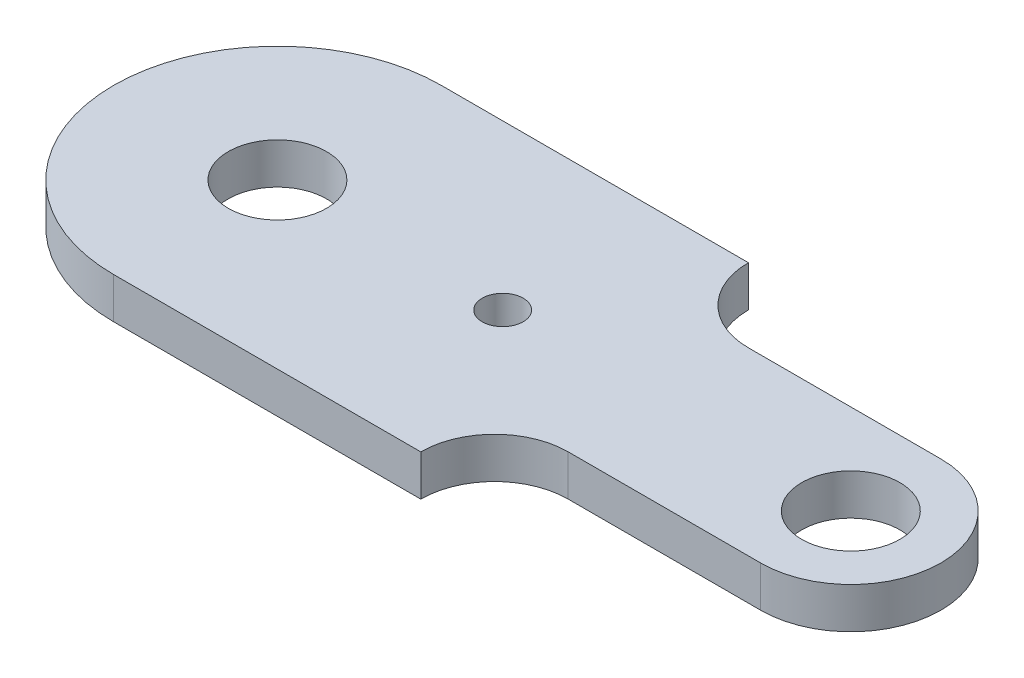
ISO-10303-21;
HEADER;
FILE_DESCRIPTION(('STEP AP214'),'2;1');
FILE_NAME('part.step','',(''),(''),'','','');
FILE_SCHEMA(('AUTOMOTIVE_DESIGN { 1 0 10303 214 1 1 1 1 }'));
ENDSEC;
DATA;
#1=APPLICATION_CONTEXT('core data for automotive mechanical design processes');
#2=APPLICATION_PROTOCOL_DEFINITION('international standard','automotive_design',2000,#1);
#3=PRODUCT_CONTEXT('',#1,'mechanical');
#4=PRODUCT('Part','Part','',(#3));
#5=PRODUCT_RELATED_PRODUCT_CATEGORY('part','',(#4));
#6=PRODUCT_DEFINITION_FORMATION('','',#4);
#7=PRODUCT_DEFINITION_CONTEXT('part definition',#1,'design');
#8=PRODUCT_DEFINITION('design','',#6,#7);
#9=PRODUCT_DEFINITION_SHAPE('','',#8);
#10=(LENGTH_UNIT() NAMED_UNIT(*) SI_UNIT(.MILLI.,.METRE.));
#11=(NAMED_UNIT(*) PLANE_ANGLE_UNIT() SI_UNIT($,.RADIAN.));
#12=(NAMED_UNIT(*) SI_UNIT($,.STERADIAN.) SOLID_ANGLE_UNIT());
#13=UNCERTAINTY_MEASURE_WITH_UNIT(LENGTH_MEASURE(1.E-05),#10,'distance_accuracy_value','');
#14=(GEOMETRIC_REPRESENTATION_CONTEXT(3) GLOBAL_UNCERTAINTY_ASSIGNED_CONTEXT((#13)) GLOBAL_UNIT_ASSIGNED_CONTEXT((#10,
#11,#12)) REPRESENTATION_CONTEXT('',''));
#15=CARTESIAN_POINT('',(0.,0.,0.));
#16=DIRECTION('',(0.,0.,1.));
#17=DIRECTION('',(1.,0.,0.));
#18=AXIS2_PLACEMENT_3D('',#15,#16,#17);
#19=CARTESIAN_POINT('',(0.,254.,0.));
#20=DIRECTION('',(0.,1.,0.));
#21=DIRECTION('',(0.,0.,1.));
#22=AXIS2_PLACEMENT_3D('',#19,#20,#21);
#23=PLANE('',#22);
#24=CARTESIAN_POINT('',(1397.,254.,0.));
#25=DIRECTION('',(0.,1.,0.));
#26=DIRECTION('',(0.,0.,1.));
#27=AXIS2_PLACEMENT_3D('',#24,#25,#26);
#28=CIRCLE('',#27,127.);
#29=CARTESIAN_POINT('',(1397.,254.,127.));
#30=VERTEX_POINT('',#29);
#31=EDGE_CURVE('E182',#30,#30,#28,.T.);
#32=ORIENTED_EDGE('',*,*,#31,.F.);
#33=EDGE_LOOP('',(#32));
#34=FACE_BOUND('',#33,.T.);
#35=CARTESIAN_POINT('',(0.,254.,0.));
#36=DIRECTION('',(0.,1.,0.));
#37=DIRECTION('',(0.,0.,1.));
#38=AXIS2_PLACEMENT_3D('',#35,#36,#37);
#39=CIRCLE('',#38,1016.);
#40=CARTESIAN_POINT('',(0.,254.,-1016.));
#41=VERTEX_POINT('',#40);
#42=CARTESIAN_POINT('',(0.,254.,1016.));
#43=VERTEX_POINT('',#42);
#44=EDGE_CURVE('E145',#41,#43,#39,.T.);
#45=ORIENTED_EDGE('',*,*,#44,.T.);
#46=DIRECTION('',(1.,0.,0.));
#47=VECTOR('',#46,1.);
#48=CARTESIAN_POINT('',(0.,254.,1016.));
#49=LINE('',#48,#47);
#50=CARTESIAN_POINT('',(1905.,254.,1016.));
#51=VERTEX_POINT('',#50);
#52=EDGE_CURVE('E93',#43,#51,#49,.T.);
#53=ORIENTED_EDGE('',*,*,#52,.T.);
#54=CARTESIAN_POINT('',(2362.2,254.,1016.));
#55=DIRECTION('',(0.,-1.,0.));
#56=DIRECTION('',(0.,0.,1.));
#57=AXIS2_PLACEMENT_3D('',#54,#55,#56);
#58=CIRCLE('',#57,457.2);
#59=CARTESIAN_POINT('',(2362.2,254.,558.8));
#60=VERTEX_POINT('',#59);
#61=EDGE_CURVE('E160',#51,#60,#58,.T.);
#62=ORIENTED_EDGE('',*,*,#61,.T.);
#63=DIRECTION('',(1.,0.,0.));
#64=VECTOR('',#63,1.);
#65=CARTESIAN_POINT('',(2362.2,254.,558.8));
#66=LINE('',#65,#64);
#67=CARTESIAN_POINT('',(3556.,254.,558.8));
#68=VERTEX_POINT('',#67);
#69=EDGE_CURVE('E173',#60,#68,#66,.T.);
#70=ORIENTED_EDGE('',*,*,#69,.T.);
#71=CARTESIAN_POINT('',(3556.,254.,0.));
#72=DIRECTION('',(0.,1.,0.));
#73=DIRECTION('',(0.,0.,1.));
#74=AXIS2_PLACEMENT_3D('',#71,#72,#73);
#75=CIRCLE('',#74,558.8);
#76=CARTESIAN_POINT('',(3556.,254.,-558.8));
#77=VERTEX_POINT('',#76);
#78=EDGE_CURVE('E112',#68,#77,#75,.T.);
#79=ORIENTED_EDGE('',*,*,#78,.T.);
#80=DIRECTION('',(-1.,0.,0.));
#81=VECTOR('',#80,1.);
#82=CARTESIAN_POINT('',(2362.2,254.,-558.8));
#83=LINE('',#82,#81);
#84=CARTESIAN_POINT('',(2362.2,254.,-558.8));
#85=VERTEX_POINT('',#84);
#86=EDGE_CURVE('E106',#77,#85,#83,.T.);
#87=ORIENTED_EDGE('',*,*,#86,.T.);
#88=CARTESIAN_POINT('',(2362.2,254.,-1016.));
#89=DIRECTION('',(0.,-1.,0.));
#90=DIRECTION('',(0.,0.,-1.));
#91=AXIS2_PLACEMENT_3D('',#88,#89,#90);
#92=CIRCLE('',#91,457.2);
#93=CARTESIAN_POINT('',(1905.,254.,-1016.));
#94=VERTEX_POINT('',#93);
#95=EDGE_CURVE('E110',#85,#94,#92,.T.);
#96=ORIENTED_EDGE('',*,*,#95,.T.);
#97=DIRECTION('',(-1.,0.,0.));
#98=VECTOR('',#97,1.);
#99=CARTESIAN_POINT('',(0.,254.,-1016.));
#100=LINE('',#99,#98);
#101=EDGE_CURVE('E50',#94,#41,#100,.T.);
#102=ORIENTED_EDGE('',*,*,#101,.T.);
#103=EDGE_LOOP('',(#45,#53,#62,#70,#79,#87,#96,#102));
#104=FACE_BOUND('',#103,.T.);
#105=CARTESIAN_POINT('',(0.,254.,0.));
#106=DIRECTION('',(0.,1.,0.));
#107=DIRECTION('',(0.,0.,1.));
#108=AXIS2_PLACEMENT_3D('',#105,#106,#107);
#109=CIRCLE('',#108,304.8);
#110=CARTESIAN_POINT('',(0.,254.,304.8));
#111=VERTEX_POINT('',#110);
#112=EDGE_CURVE('E134',#111,#111,#109,.T.);
#113=ORIENTED_EDGE('',*,*,#112,.F.);
#114=EDGE_LOOP('',(#113));
#115=FACE_BOUND('',#114,.T.);
#116=CARTESIAN_POINT('',(3556.,254.,0.));
#117=DIRECTION('',(0.,1.,0.));
#118=DIRECTION('',(0.,0.,1.));
#119=AXIS2_PLACEMENT_3D('',#116,#117,#118);
#120=CIRCLE('',#119,304.8);
#121=CARTESIAN_POINT('',(3556.,254.,304.8));
#122=VERTEX_POINT('',#121);
#123=EDGE_CURVE('E188',#122,#122,#120,.T.);
#124=ORIENTED_EDGE('',*,*,#123,.F.);
#125=EDGE_LOOP('',(#124));
#126=FACE_BOUND('',#125,.T.);
#127=ADVANCED_FACE('F33',(#34,#104,#115,#126),#23,.T.);
#128=CARTESIAN_POINT('',(0.,0.,0.));
#129=DIRECTION('',(0.,1.,0.));
#130=DIRECTION('',(0.,0.,1.));
#131=AXIS2_PLACEMENT_3D('',#128,#129,#130);
#132=PLANE('',#131);
#133=CARTESIAN_POINT('',(0.,0.,0.));
#134=DIRECTION('',(0.,1.,0.));
#135=DIRECTION('',(0.,0.,1.));
#136=AXIS2_PLACEMENT_3D('',#133,#134,#135);
#137=CIRCLE('',#136,1016.);
#138=CARTESIAN_POINT('',(0.,0.,-1016.));
#139=VERTEX_POINT('',#138);
#140=CARTESIAN_POINT('',(0.,0.,1016.));
#141=VERTEX_POINT('',#140);
#142=EDGE_CURVE('E130',#139,#141,#137,.T.);
#143=ORIENTED_EDGE('',*,*,#142,.F.);
#144=DIRECTION('',(-1.,0.,0.));
#145=VECTOR('',#144,1.);
#146=CARTESIAN_POINT('',(0.,0.,-1016.));
#147=LINE('',#146,#145);
#148=CARTESIAN_POINT('',(1905.,0.,-1016.));
#149=VERTEX_POINT('',#148);
#150=EDGE_CURVE('E85',#149,#139,#147,.T.);
#151=ORIENTED_EDGE('',*,*,#150,.F.);
#152=CARTESIAN_POINT('',(2362.2,0.,-1016.));
#153=DIRECTION('',(0.,-1.,0.));
#154=DIRECTION('',(0.,0.,-1.));
#155=AXIS2_PLACEMENT_3D('',#152,#153,#154);
#156=CIRCLE('',#155,457.2);
#157=CARTESIAN_POINT('',(2362.2,0.,-558.8));
#158=VERTEX_POINT('',#157);
#159=EDGE_CURVE('E79',#158,#149,#156,.T.);
#160=ORIENTED_EDGE('',*,*,#159,.F.);
#161=DIRECTION('',(-1.,0.,0.));
#162=VECTOR('',#161,1.);
#163=CARTESIAN_POINT('',(2362.2,0.,-558.8));
#164=LINE('',#163,#162);
#165=CARTESIAN_POINT('',(3556.,0.,-558.8));
#166=VERTEX_POINT('',#165);
#167=EDGE_CURVE('E120',#166,#158,#164,.T.);
#168=ORIENTED_EDGE('',*,*,#167,.F.);
#169=CARTESIAN_POINT('',(3556.,0.,0.));
#170=DIRECTION('',(0.,1.,0.));
#171=DIRECTION('',(0.,0.,1.));
#172=AXIS2_PLACEMENT_3D('',#169,#170,#171);
#173=CIRCLE('',#172,558.8);
#174=CARTESIAN_POINT('',(3556.,0.,558.8));
#175=VERTEX_POINT('',#174);
#176=EDGE_CURVE('E140',#175,#166,#173,.T.);
#177=ORIENTED_EDGE('',*,*,#176,.F.);
#178=DIRECTION('',(1.,0.,0.));
#179=VECTOR('',#178,1.);
#180=CARTESIAN_POINT('',(2362.2,0.,558.8));
#181=LINE('',#180,#179);
#182=CARTESIAN_POINT('',(2362.2,0.,558.8));
#183=VERTEX_POINT('',#182);
#184=EDGE_CURVE('E138',#183,#175,#181,.T.);
#185=ORIENTED_EDGE('',*,*,#184,.F.);
#186=CARTESIAN_POINT('',(2362.2,0.,1016.));
#187=DIRECTION('',(0.,-1.,0.));
#188=DIRECTION('',(0.,0.,1.));
#189=AXIS2_PLACEMENT_3D('',#186,#187,#188);
#190=CIRCLE('',#189,457.2);
#191=CARTESIAN_POINT('',(1905.,0.,1016.));
#192=VERTEX_POINT('',#191);
#193=EDGE_CURVE('E136',#192,#183,#190,.T.);
#194=ORIENTED_EDGE('',*,*,#193,.F.);
#195=DIRECTION('',(1.,0.,0.));
#196=VECTOR('',#195,1.);
#197=CARTESIAN_POINT('',(0.,0.,1016.));
#198=LINE('',#197,#196);
#199=EDGE_CURVE('E133',#141,#192,#198,.T.);
#200=ORIENTED_EDGE('',*,*,#199,.F.);
#201=EDGE_LOOP('',(#143,#151,#160,#168,#177,#185,#194,#200));
#202=FACE_BOUND('',#201,.T.);
#203=CARTESIAN_POINT('',(0.,0.,0.));
#204=DIRECTION('',(0.,1.,0.));
#205=DIRECTION('',(0.,0.,1.));
#206=AXIS2_PLACEMENT_3D('',#203,#204,#205);
#207=CIRCLE('',#206,304.8);
#208=CARTESIAN_POINT('',(0.,0.,304.8));
#209=VERTEX_POINT('',#208);
#210=EDGE_CURVE('E179',#209,#209,#207,.T.);
#211=ORIENTED_EDGE('',*,*,#210,.T.);
#212=EDGE_LOOP('',(#211));
#213=FACE_BOUND('',#212,.T.);
#214=CARTESIAN_POINT('',(1397.,0.,0.));
#215=DIRECTION('',(0.,1.,0.));
#216=DIRECTION('',(0.,0.,1.));
#217=AXIS2_PLACEMENT_3D('',#214,#215,#216);
#218=CIRCLE('',#217,127.);
#219=CARTESIAN_POINT('',(1397.,0.,127.));
#220=VERTEX_POINT('',#219);
#221=EDGE_CURVE('E185',#220,#220,#218,.T.);
#222=ORIENTED_EDGE('',*,*,#221,.T.);
#223=EDGE_LOOP('',(#222));
#224=FACE_BOUND('',#223,.T.);
#225=CARTESIAN_POINT('',(3556.,0.,0.));
#226=DIRECTION('',(0.,1.,0.));
#227=DIRECTION('',(0.,0.,1.));
#228=AXIS2_PLACEMENT_3D('',#225,#226,#227);
#229=CIRCLE('',#228,304.8);
#230=CARTESIAN_POINT('',(3556.,0.,304.8));
#231=VERTEX_POINT('',#230);
#232=EDGE_CURVE('E191',#231,#231,#229,.T.);
#233=ORIENTED_EDGE('',*,*,#232,.T.);
#234=EDGE_LOOP('',(#233));
#235=FACE_BOUND('',#234,.T.);
#236=ADVANCED_FACE('F164',(#202,#213,#224,#235),#132,.F.);
#237=CARTESIAN_POINT('',(0.,254.,0.));
#238=DIRECTION('',(0.,-1.,0.));
#239=DIRECTION('',(0.,0.,-1.));
#240=AXIS2_PLACEMENT_3D('',#237,#238,#239);
#241=CYLINDRICAL_SURFACE('',#240,1016.);
#242=ORIENTED_EDGE('',*,*,#142,.T.);
#243=DIRECTION('',(0.,-1.,0.));
#244=VECTOR('',#243,1.);
#245=CARTESIAN_POINT('',(0.,254.,1016.));
#246=LINE('',#245,#244);
#247=EDGE_CURVE('E11',#43,#141,#246,.T.);
#248=ORIENTED_EDGE('',*,*,#247,.F.);
#249=ORIENTED_EDGE('',*,*,#44,.F.);
#250=DIRECTION('',(0.,-1.,0.));
#251=VECTOR('',#250,1.);
#252=CARTESIAN_POINT('',(0.,254.,-1016.));
#253=LINE('',#252,#251);
#254=EDGE_CURVE('E126',#41,#139,#253,.T.);
#255=ORIENTED_EDGE('',*,*,#254,.T.);
#256=EDGE_LOOP('',(#242,#248,#249,#255));
#257=FACE_BOUND('',#256,.T.);
#258=ADVANCED_FACE('F35',(#257),#241,.T.);
#259=CARTESIAN_POINT('',(0.,254.,1016.));
#260=DIRECTION('',(0.,0.,-1.));
#261=DIRECTION('',(-1.,0.,0.));
#262=AXIS2_PLACEMENT_3D('',#259,#260,#261);
#263=PLANE('',#262);
#264=ORIENTED_EDGE('',*,*,#199,.T.);
#265=DIRECTION('',(0.,-1.,0.));
#266=VECTOR('',#265,1.);
#267=CARTESIAN_POINT('',(1905.,254.,1016.));
#268=LINE('',#267,#266);
#269=EDGE_CURVE('E42',#51,#192,#268,.T.);
#270=ORIENTED_EDGE('',*,*,#269,.F.);
#271=ORIENTED_EDGE('',*,*,#52,.F.);
#272=ORIENTED_EDGE('',*,*,#247,.T.);
#273=EDGE_LOOP('',(#264,#270,#271,#272));
#274=FACE_BOUND('',#273,.T.);
#275=ADVANCED_FACE('F224',(#274),#263,.F.);
#276=CARTESIAN_POINT('',(2362.2,254.,1016.));
#277=DIRECTION('',(0.,-1.,0.));
#278=DIRECTION('',(0.,0.,-1.));
#279=AXIS2_PLACEMENT_3D('',#276,#277,#278);
#280=CYLINDRICAL_SURFACE('',#279,457.2);
#281=ORIENTED_EDGE('',*,*,#193,.T.);
#282=DIRECTION('',(0.,-1.,0.));
#283=VECTOR('',#282,1.);
#284=CARTESIAN_POINT('',(2362.2,254.,558.8));
#285=LINE('',#284,#283);
#286=EDGE_CURVE('E152',#60,#183,#285,.T.);
#287=ORIENTED_EDGE('',*,*,#286,.F.);
#288=ORIENTED_EDGE('',*,*,#61,.F.);
#289=ORIENTED_EDGE('',*,*,#269,.T.);
#290=EDGE_LOOP('',(#281,#287,#288,#289));
#291=FACE_BOUND('',#290,.T.);
#292=ADVANCED_FACE('F158',(#291),#280,.F.);
#293=CARTESIAN_POINT('',(2362.2,254.,558.8));
#294=DIRECTION('',(0.,0.,-1.));
#295=DIRECTION('',(-1.,0.,0.));
#296=AXIS2_PLACEMENT_3D('',#293,#294,#295);
#297=PLANE('',#296);
#298=ORIENTED_EDGE('',*,*,#184,.T.);
#299=DIRECTION('',(0.,-1.,0.));
#300=VECTOR('',#299,1.);
#301=CARTESIAN_POINT('',(3556.,254.,558.8));
#302=LINE('',#301,#300);
#303=EDGE_CURVE('E149',#68,#175,#302,.T.);
#304=ORIENTED_EDGE('',*,*,#303,.F.);
#305=ORIENTED_EDGE('',*,*,#69,.F.);
#306=ORIENTED_EDGE('',*,*,#286,.T.);
#307=EDGE_LOOP('',(#298,#304,#305,#306));
#308=FACE_BOUND('',#307,.T.);
#309=ADVANCED_FACE('F169',(#308),#297,.F.);
#310=CARTESIAN_POINT('',(3556.,254.,0.));
#311=DIRECTION('',(0.,-1.,0.));
#312=DIRECTION('',(0.,0.,-1.));
#313=AXIS2_PLACEMENT_3D('',#310,#311,#312);
#314=CYLINDRICAL_SURFACE('',#313,558.8);
#315=ORIENTED_EDGE('',*,*,#176,.T.);
#316=DIRECTION('',(0.,-1.,0.));
#317=VECTOR('',#316,1.);
#318=CARTESIAN_POINT('',(3556.,254.,-558.8));
#319=LINE('',#318,#317);
#320=EDGE_CURVE('E121',#77,#166,#319,.T.);
#321=ORIENTED_EDGE('',*,*,#320,.F.);
#322=ORIENTED_EDGE('',*,*,#78,.F.);
#323=ORIENTED_EDGE('',*,*,#303,.T.);
#324=EDGE_LOOP('',(#315,#321,#322,#323));
#325=FACE_BOUND('',#324,.T.);
#326=ADVANCED_FACE('F172',(#325),#314,.T.);
#327=CARTESIAN_POINT('',(2362.2,254.,-558.8));
#328=DIRECTION('',(0.,0.,1.));
#329=DIRECTION('',(1.,0.,0.));
#330=AXIS2_PLACEMENT_3D('',#327,#328,#329);
#331=PLANE('',#330);
#332=ORIENTED_EDGE('',*,*,#167,.T.);
#333=DIRECTION('',(0.,-1.,0.));
#334=VECTOR('',#333,1.);
#335=CARTESIAN_POINT('',(2362.2,254.,-558.8));
#336=LINE('',#335,#334);
#337=EDGE_CURVE('E117',#85,#158,#336,.T.);
#338=ORIENTED_EDGE('',*,*,#337,.F.);
#339=ORIENTED_EDGE('',*,*,#86,.F.);
#340=ORIENTED_EDGE('',*,*,#320,.T.);
#341=EDGE_LOOP('',(#332,#338,#339,#340));
#342=FACE_BOUND('',#341,.T.);
#343=ADVANCED_FACE('F118',(#342),#331,.F.);
#344=CARTESIAN_POINT('',(2362.2,254.,-1016.));
#345=DIRECTION('',(0.,-1.,0.));
#346=DIRECTION('',(0.,0.,-1.));
#347=AXIS2_PLACEMENT_3D('',#344,#345,#346);
#348=CYLINDRICAL_SURFACE('',#347,457.2);
#349=ORIENTED_EDGE('',*,*,#159,.T.);
#350=DIRECTION('',(0.,-1.,0.));
#351=VECTOR('',#350,1.);
#352=CARTESIAN_POINT('',(1905.,254.,-1016.));
#353=LINE('',#352,#351);
#354=EDGE_CURVE('E122',#94,#149,#353,.T.);
#355=ORIENTED_EDGE('',*,*,#354,.F.);
#356=ORIENTED_EDGE('',*,*,#95,.F.);
#357=ORIENTED_EDGE('',*,*,#337,.T.);
#358=EDGE_LOOP('',(#349,#355,#356,#357));
#359=FACE_BOUND('',#358,.T.);
#360=ADVANCED_FACE('F124',(#359),#348,.F.);
#361=CARTESIAN_POINT('',(0.,254.,-1016.));
#362=DIRECTION('',(0.,0.,1.));
#363=DIRECTION('',(1.,0.,0.));
#364=AXIS2_PLACEMENT_3D('',#361,#362,#363);
#365=PLANE('',#364);
#366=ORIENTED_EDGE('',*,*,#150,.T.);
#367=ORIENTED_EDGE('',*,*,#254,.F.);
#368=ORIENTED_EDGE('',*,*,#101,.F.);
#369=ORIENTED_EDGE('',*,*,#354,.T.);
#370=EDGE_LOOP('',(#366,#367,#368,#369));
#371=FACE_BOUND('',#370,.T.);
#372=ADVANCED_FACE('F212',(#371),#365,.F.);
#373=CARTESIAN_POINT('',(0.,254.,0.));
#374=DIRECTION('',(0.,-1.,0.));
#375=DIRECTION('',(0.,0.,-1.));
#376=AXIS2_PLACEMENT_3D('',#373,#374,#375);
#377=CYLINDRICAL_SURFACE('',#376,304.8);
#378=ORIENTED_EDGE('',*,*,#112,.T.);
#379=EDGE_LOOP('',(#378));
#380=FACE_BOUND('',#379,.T.);
#381=ORIENTED_EDGE('',*,*,#210,.F.);
#382=EDGE_LOOP('',(#381));
#383=FACE_BOUND('',#382,.T.);
#384=ADVANCED_FACE('F209',(#380,#383),#377,.F.);
#385=CARTESIAN_POINT('',(1397.,254.,0.));
#386=DIRECTION('',(0.,-1.,0.));
#387=DIRECTION('',(0.,0.,-1.));
#388=AXIS2_PLACEMENT_3D('',#385,#386,#387);
#389=CYLINDRICAL_SURFACE('',#388,127.);
#390=ORIENTED_EDGE('',*,*,#31,.T.);
#391=EDGE_LOOP('',(#390));
#392=FACE_BOUND('',#391,.T.);
#393=ORIENTED_EDGE('',*,*,#221,.F.);
#394=EDGE_LOOP('',(#393));
#395=FACE_BOUND('',#394,.T.);
#396=ADVANCED_FACE('F288',(#392,#395),#389,.F.);
#397=CARTESIAN_POINT('',(3556.,254.,0.));
#398=DIRECTION('',(0.,-1.,0.));
#399=DIRECTION('',(0.,0.,-1.));
#400=AXIS2_PLACEMENT_3D('',#397,#398,#399);
#401=CYLINDRICAL_SURFACE('',#400,304.8);
#402=ORIENTED_EDGE('',*,*,#123,.T.);
#403=EDGE_LOOP('',(#402));
#404=FACE_BOUND('',#403,.T.);
#405=ORIENTED_EDGE('',*,*,#232,.F.);
#406=EDGE_LOOP('',(#405));
#407=FACE_BOUND('',#406,.T.);
#408=ADVANCED_FACE('F197',(#404,#407),#401,.F.);
#409=CLOSED_SHELL('',(#127,#236,#258,#275,#292,#309,#326,#343,#360,#372,#384,#396,#408));
#410=MANIFOLD_SOLID_BREP('B2',#409);
#411=ADVANCED_BREP_SHAPE_REPRESENTATION('',(#18,#410),#14);
#412=SHAPE_DEFINITION_REPRESENTATION(#9,#411);
ENDSEC;
END-ISO-10303-21;
